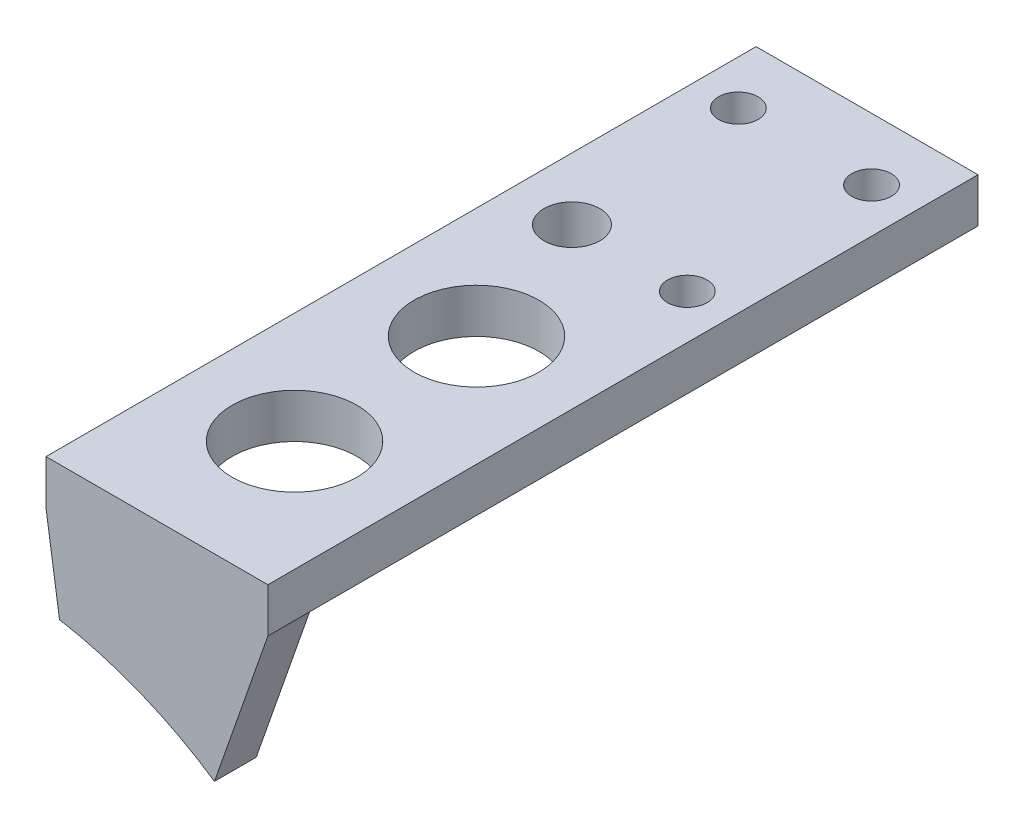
from build123d import *

# Parameters (mm, degrees)
EXTRUDE1_DEPTH                  = 1.1938
EXTRUDE1_DEPTH_BACK             = 1.1938
SKETCH2_W                       = 12.7
SKETCH2_H                       = 40.64
EXTRUDE2_DEPTH                  = 2.54
F_1_8_0_125000_DIAMETER_HOLE1_D = 3.2004
F_43_0_089000_DIAMETER_HOLE1_D  = 2.2606
F_9_32_0_28125_DIAMETER_HOLE1_D = 7.14375
SKETCH9_R                       = 22.86
EXTRUDE3_DEPTH                  = 51.112725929


with BuildPart() as part:
    # Sketch1 → Extrude1 (new, two sides: drawn at the far end of the back side and taken through both)
    with BuildSketch(Plane.XY.offset(-EXTRUDE1_DEPTH_BACK)):
        with BuildLine():
            Line((-1.883923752, 12.559491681), (-3.81, 25.4))
            Line((-3.81, 25.4), (8.89, 25.4))
            Line((8.89, 25.4), (4.195450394, 11.987001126))
            ThreePointArc((4.195450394, 11.987001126), (1.190682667, 12.64406085), (-1.883923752, 12.559491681))
        make_face()
    extrude(amount=EXTRUDE1_DEPTH + EXTRUDE1_DEPTH_BACK)

    # Sketch2 → Extrude2 (add)
    with BuildSketch(Plane(origin=(0, 25.4, 0), x_dir=(-1, 0, 0), z_dir=(0, 1, 0))):
        with Locations((-2.54, -19.1262)):
            Rectangle(SKETCH2_W, SKETCH2_H)
    extrude(amount=EXTRUDE2_DEPTH)

    # 1_8 _0.125000_ Diameter Hole1 (through all)
    with Locations(Plane(origin=(0, 27.94, 0), x_dir=(-1, 0, 0), z_dir=(0, 1, 0))):
        with Locations((0.254, -25.3492)):
            Hole(F_1_8_0_125000_DIAMETER_HOLE1_D / 2)

    # 43 _0.089000_ Diameter Hole1 (through all)
    with Locations(Plane(origin=(0, 27.94, 0), x_dir=(-1, 0, 0), z_dir=(0, 1, 0))):
        with Locations((-6.35, -35.8902), (1.27, -35.8902), (-6.35, -25.3492)):
            Hole(F_43_0_089000_DIAMETER_HOLE1_D / 2)

    # 9_32 _0.28125_ Diameter Hole1 (through all)
    with Locations(Plane(origin=(0, 27.94, 0), x_dir=(-1, 0, 0), z_dir=(0, 1, 0))):
        with Locations((-2.54, -6.6802), (-2.54, -17.0942)):
            Hole(F_9_32_0_28125_DIAMETER_HOLE1_D / 2)

    # Sketch9 → Extrude3 (cut, through all)
    with BuildSketch(Plane.XY.offset(1.1938)):
        with Locations((-6.973044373, -2.274720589)):
            Circle(SKETCH9_R)
    extrude(amount=-EXTRUDE3_DEPTH, mode=Mode.SUBTRACT)


solid = part.part
